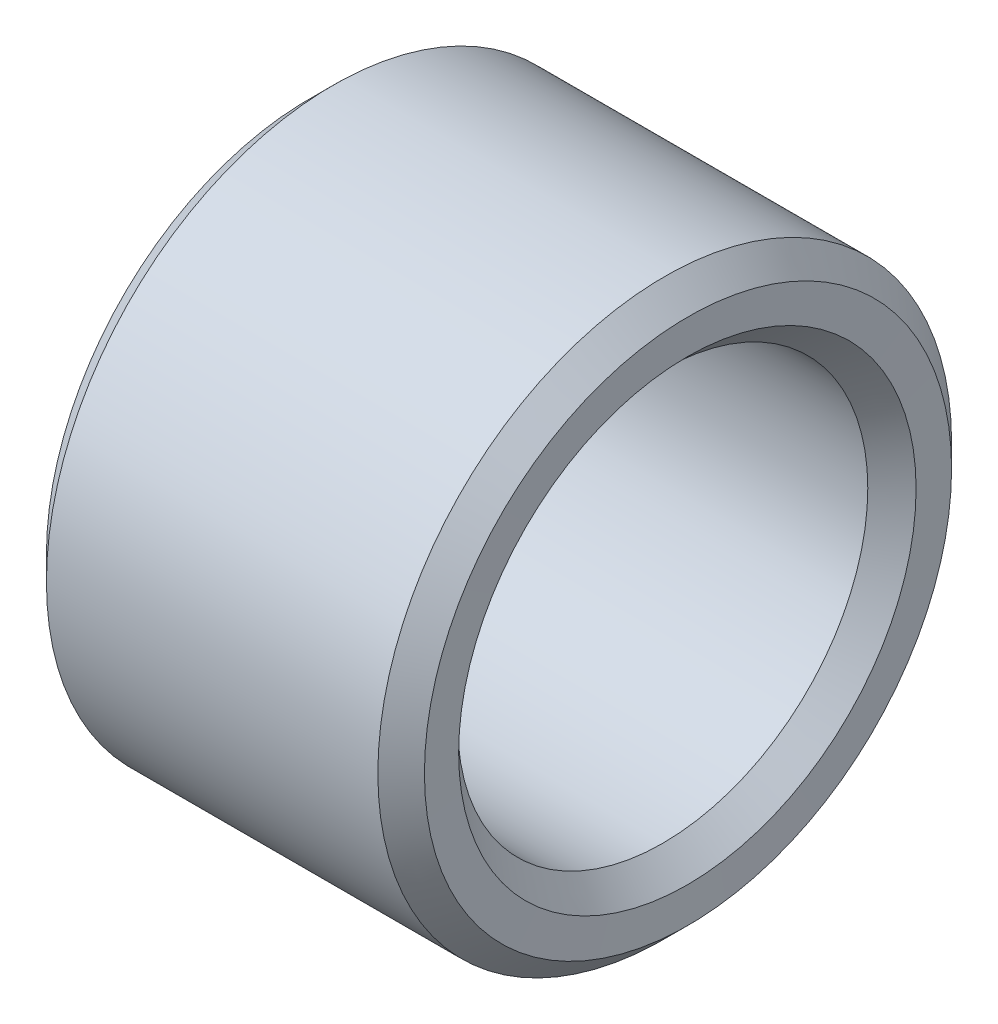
ISO-10303-21;
HEADER;
FILE_DESCRIPTION(('STEP AP214'),'2;1');
FILE_NAME('part.step','',(''),(''),'','','');
FILE_SCHEMA(('AUTOMOTIVE_DESIGN { 1 0 10303 214 1 1 1 1 }'));
ENDSEC;
DATA;
#1=APPLICATION_CONTEXT('core data for automotive mechanical design processes');
#2=APPLICATION_PROTOCOL_DEFINITION('international standard','automotive_design',2000,#1);
#3=PRODUCT_CONTEXT('',#1,'mechanical');
#4=PRODUCT('Part','Part','',(#3));
#5=PRODUCT_RELATED_PRODUCT_CATEGORY('part','',(#4));
#6=PRODUCT_DEFINITION_FORMATION('','',#4);
#7=PRODUCT_DEFINITION_CONTEXT('part definition',#1,'design');
#8=PRODUCT_DEFINITION('design','',#6,#7);
#9=PRODUCT_DEFINITION_SHAPE('','',#8);
#10=(LENGTH_UNIT() NAMED_UNIT(*) SI_UNIT(.MILLI.,.METRE.));
#11=(NAMED_UNIT(*) PLANE_ANGLE_UNIT() SI_UNIT($,.RADIAN.));
#12=(NAMED_UNIT(*) SI_UNIT($,.STERADIAN.) SOLID_ANGLE_UNIT());
#13=UNCERTAINTY_MEASURE_WITH_UNIT(LENGTH_MEASURE(1.E-05),#10,'distance_accuracy_value','');
#14=(GEOMETRIC_REPRESENTATION_CONTEXT(3) GLOBAL_UNCERTAINTY_ASSIGNED_CONTEXT((#13)) GLOBAL_UNIT_ASSIGNED_CONTEXT((#10,
#11,#12)) REPRESENTATION_CONTEXT('',''));
#15=CARTESIAN_POINT('',(0.,0.,0.));
#16=DIRECTION('',(0.,0.,1.));
#17=DIRECTION('',(1.,0.,0.));
#18=AXIS2_PLACEMENT_3D('',#15,#16,#17);
#19=CARTESIAN_POINT('',(-305.,-82.1405486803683,0.));
#20=DIRECTION('',(1.,0.,0.));
#21=DIRECTION('',(0.,0.,-1.));
#22=AXIS2_PLACEMENT_3D('',#19,#20,#21);
#23=CYLINDRICAL_SURFACE('',#22,6.04821440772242);
#24=CARTESIAN_POINT('',(-324.784792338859,-82.1405486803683,0.));
#25=DIRECTION('',(1.,0.,0.));
#26=DIRECTION('',(0.,0.,-1.));
#27=AXIS2_PLACEMENT_3D('',#24,#25,#26);
#28=CIRCLE('',#27,6.04821440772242);
#29=CARTESIAN_POINT('',(-324.784792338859,-82.1405486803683,-6.04821440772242));
#30=VERTEX_POINT('',#29);
#31=EDGE_CURVE('E50',#30,#30,#28,.F.);
#32=ORIENTED_EDGE('',*,*,#31,.T.);
#33=EDGE_LOOP('',(#32));
#34=FACE_BOUND('',#33,.T.);
#35=CARTESIAN_POINT('',(-331.77244177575,-82.1405486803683,0.));
#36=DIRECTION('',(-1.,0.,0.));
#37=DIRECTION('',(0.,0.,1.));
#38=AXIS2_PLACEMENT_3D('',#35,#36,#37);
#39=CIRCLE('',#38,6.04821440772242);
#40=CARTESIAN_POINT('',(-331.77244177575,-82.1405486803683,6.04821440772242));
#41=VERTEX_POINT('',#40);
#42=EDGE_CURVE('E53',#41,#41,#39,.F.);
#43=ORIENTED_EDGE('',*,*,#42,.T.);
#44=EDGE_LOOP('',(#43));
#45=FACE_BOUND('',#44,.T.);
#46=ADVANCED_FACE('F30',(#34,#45),#23,.T.);
#47=CARTESIAN_POINT('',(-332.27244177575,-77.8179048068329,0.));
#48=DIRECTION('',(-1.,0.,0.));
#49=DIRECTION('',(0.,0.,1.));
#50=AXIS2_PLACEMENT_3D('',#47,#48,#49);
#51=PLANE('',#50);
#52=CARTESIAN_POINT('',(-332.27244177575,-82.1405486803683,0.));
#53=DIRECTION('',(-1.,0.,0.));
#54=DIRECTION('',(0.,0.,1.));
#55=AXIS2_PLACEMENT_3D('',#52,#53,#54);
#56=CIRCLE('',#55,4.82264387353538);
#57=CARTESIAN_POINT('',(-332.27244177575,-82.1405486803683,4.82264387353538));
#58=VERTEX_POINT('',#57);
#59=EDGE_CURVE('E10',#58,#58,#56,.F.);
#60=ORIENTED_EDGE('',*,*,#59,.T.);
#61=EDGE_LOOP('',(#60));
#62=FACE_BOUND('',#61,.T.);
#63=CARTESIAN_POINT('',(-332.27244177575,-82.1405486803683,0.));
#64=DIRECTION('',(-1.,0.,0.));
#65=DIRECTION('',(0.,0.,1.));
#66=AXIS2_PLACEMENT_3D('',#63,#64,#65);
#67=CIRCLE('',#66,5.5482144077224);
#68=CARTESIAN_POINT('',(-332.27244177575,-82.1405486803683,5.5482144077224));
#69=VERTEX_POINT('',#68);
#70=EDGE_CURVE('E37',#69,#69,#67,.T.);
#71=ORIENTED_EDGE('',*,*,#70,.T.);
#72=EDGE_LOOP('',(#71));
#73=FACE_BOUND('',#72,.T.);
#74=ADVANCED_FACE('F76',(#62,#73),#51,.T.);
#75=CARTESIAN_POINT('',(-305.,-82.1405486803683,0.));
#76=DIRECTION('',(1.,0.,0.));
#77=DIRECTION('',(0.,0.,-1.));
#78=AXIS2_PLACEMENT_3D('',#75,#76,#77);
#79=CYLINDRICAL_SURFACE('',#78,4.3226438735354);
#80=CARTESIAN_POINT('',(-324.825639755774,-82.1405486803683,0.));
#81=DIRECTION('',(1.,0.,0.));
#82=DIRECTION('',(0.,0.,-1.));
#83=AXIS2_PLACEMENT_3D('',#80,#81,#82);
#84=CIRCLE('',#83,4.3226438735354);
#85=CARTESIAN_POINT('',(-324.825639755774,-82.1405486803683,-4.3226438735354));
#86=VERTEX_POINT('',#85);
#87=EDGE_CURVE('E41',#86,#86,#84,.T.);
#88=ORIENTED_EDGE('',*,*,#87,.T.);
#89=EDGE_LOOP('',(#88));
#90=FACE_BOUND('',#89,.T.);
#91=CARTESIAN_POINT('',(-331.77244177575,-82.1405486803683,0.));
#92=DIRECTION('',(-1.,0.,0.));
#93=DIRECTION('',(0.,0.,1.));
#94=AXIS2_PLACEMENT_3D('',#91,#92,#93);
#95=CIRCLE('',#94,4.3226438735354);
#96=CARTESIAN_POINT('',(-331.77244177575,-82.1405486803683,4.3226438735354));
#97=VERTEX_POINT('',#96);
#98=EDGE_CURVE('E45',#97,#97,#95,.T.);
#99=ORIENTED_EDGE('',*,*,#98,.T.);
#100=EDGE_LOOP('',(#99));
#101=FACE_BOUND('',#100,.T.);
#102=ADVANCED_FACE('F73',(#90,#101),#79,.F.);
#103=CARTESIAN_POINT('',(-324.316265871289,-82.1405486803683,0.));
#104=DIRECTION('',(1.,0.,0.));
#105=DIRECTION('',(0.,0.,-1.));
#106=AXIS2_PLACEMENT_3D('',#103,#104,#105);
#107=CONICAL_SURFACE('',#106,4.3226438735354,1.55255885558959);
#108=CARTESIAN_POINT('',(-324.293748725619,-82.1405486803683,0.));
#109=DIRECTION('',(-1.,0.,0.));
#110=DIRECTION('',(0.,0.,1.));
#111=AXIS2_PLACEMENT_3D('',#108,#109,#110);
#112=CIRCLE('',#111,5.5571707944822);
#113=CARTESIAN_POINT('',(-324.293748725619,-82.1405486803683,5.5571707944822));
#114=VERTEX_POINT('',#113);
#115=EDGE_CURVE('E56',#114,#114,#112,.F.);
#116=ORIENTED_EDGE('',*,*,#115,.T.);
#117=EDGE_LOOP('',(#116));
#118=FACE_BOUND('',#117,.T.);
#119=CARTESIAN_POINT('',(-324.307147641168,-82.1405486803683,0.));
#120=DIRECTION('',(-1.,0.,0.));
#121=DIRECTION('',(0.,0.,1.));
#122=AXIS2_PLACEMENT_3D('',#119,#120,#121);
#123=CIRCLE('',#122,4.82256072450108);
#124=CARTESIAN_POINT('',(-324.307147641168,-82.1405486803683,4.82256072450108));
#125=VERTEX_POINT('',#124);
#126=EDGE_CURVE('E59',#125,#125,#123,.T.);
#127=ORIENTED_EDGE('',*,*,#126,.T.);
#128=EDGE_LOOP('',(#127));
#129=FACE_BOUND('',#128,.T.);
#130=ADVANCED_FACE('F63',(#118,#129),#107,.F.);
#131=CARTESIAN_POINT('',(-324.293748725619,-82.1405486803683,0.));
#132=DIRECTION('',(-1.,0.,0.));
#133=DIRECTION('',(0.,0.,1.));
#134=AXIS2_PLACEMENT_3D('',#131,#132,#133);
#135=CONICAL_SURFACE('',#134,5.55717079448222,0.785398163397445);
#136=ORIENTED_EDGE('',*,*,#31,.F.);
#137=EDGE_LOOP('',(#136));
#138=FACE_BOUND('',#137,.T.);
#139=ORIENTED_EDGE('',*,*,#115,.F.);
#140=EDGE_LOOP('',(#139));
#141=FACE_BOUND('',#140,.T.);
#142=ADVANCED_FACE('F69',(#138,#141),#135,.T.);
#143=CARTESIAN_POINT('',(-324.825639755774,-82.1405486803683,0.));
#144=DIRECTION('',(1.,0.,0.));
#145=DIRECTION('',(0.,0.,-1.));
#146=AXIS2_PLACEMENT_3D('',#143,#144,#145);
#147=CONICAL_SURFACE('',#146,4.3226438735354,0.76716069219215);
#148=ORIENTED_EDGE('',*,*,#126,.F.);
#149=EDGE_LOOP('',(#148));
#150=FACE_BOUND('',#149,.T.);
#151=ORIENTED_EDGE('',*,*,#87,.F.);
#152=EDGE_LOOP('',(#151));
#153=FACE_BOUND('',#152,.T.);
#154=ADVANCED_FACE('F65',(#150,#153),#147,.F.);
#155=CARTESIAN_POINT('',(-332.27244177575,-82.1405486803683,0.));
#156=DIRECTION('',(-1.,0.,0.));
#157=DIRECTION('',(0.,0.,1.));
#158=AXIS2_PLACEMENT_3D('',#155,#156,#157);
#159=CONICAL_SURFACE('',#158,4.82264387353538,0.785398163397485);
#160=ORIENTED_EDGE('',*,*,#98,.F.);
#161=EDGE_LOOP('',(#160));
#162=FACE_BOUND('',#161,.T.);
#163=ORIENTED_EDGE('',*,*,#59,.F.);
#164=EDGE_LOOP('',(#163));
#165=FACE_BOUND('',#164,.T.);
#166=ADVANCED_FACE('F68',(#162,#165),#159,.F.);
#167=CARTESIAN_POINT('',(-331.77244177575,-82.1405486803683,0.));
#168=DIRECTION('',(1.,0.,0.));
#169=DIRECTION('',(0.,0.,-1.));
#170=AXIS2_PLACEMENT_3D('',#167,#168,#169);
#171=CONICAL_SURFACE('',#170,6.04821440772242,0.78539816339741);
#172=ORIENTED_EDGE('',*,*,#70,.F.);
#173=EDGE_LOOP('',(#172));
#174=FACE_BOUND('',#173,.T.);
#175=ORIENTED_EDGE('',*,*,#42,.F.);
#176=EDGE_LOOP('',(#175));
#177=FACE_BOUND('',#176,.T.);
#178=ADVANCED_FACE('F32',(#174,#177),#171,.T.);
#179=CLOSED_SHELL('',(#46,#74,#102,#130,#142,#154,#166,#178));
#180=MANIFOLD_SOLID_BREP('B2',#179);
#181=ADVANCED_BREP_SHAPE_REPRESENTATION('',(#18,#180),#14);
#182=SHAPE_DEFINITION_REPRESENTATION(#9,#181);
ENDSEC;
END-ISO-10303-21;
